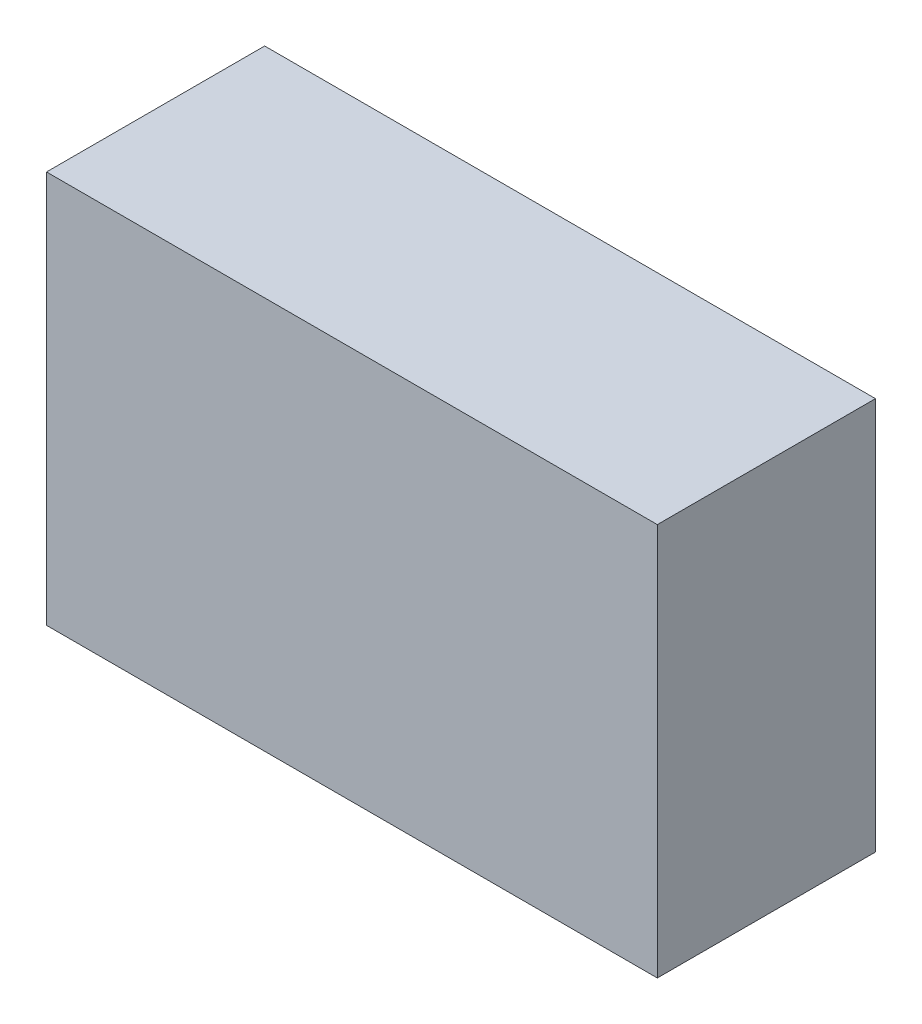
from build123d import *

# Parameters (mm, degrees)
ESQUISSE1_W      = 70
ESQUISSE1_H      = 45
EXTRUSION1_DEPTH = 25


with BuildPart() as part:
    # Esquisse1 → Extrusion1 (new body)
    with BuildSketch(Plane.XY):
        with Locations((35, 22.5)):
            Rectangle(ESQUISSE1_W, ESQUISSE1_H)
    extrude(amount=EXTRUSION1_DEPTH)


solid = part.part
